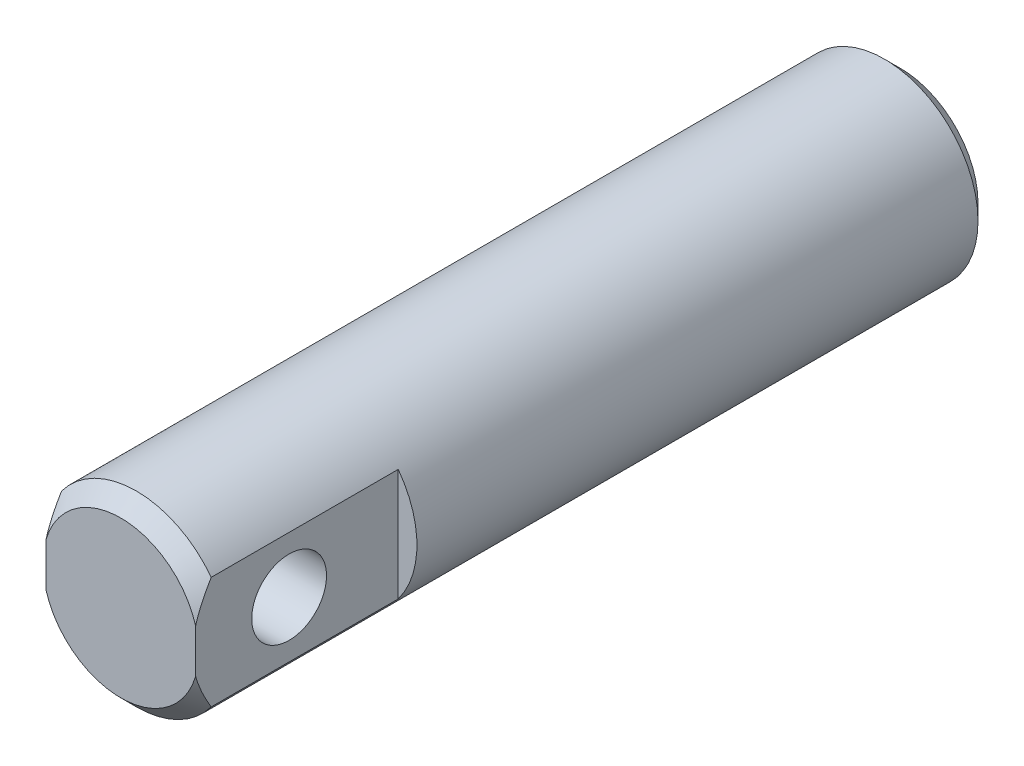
ISO-10303-21;
HEADER;
FILE_DESCRIPTION(('STEP AP214'),'2;1');
FILE_NAME('part.step','',(''),(''),'','','');
FILE_SCHEMA(('AUTOMOTIVE_DESIGN { 1 0 10303 214 1 1 1 1 }'));
ENDSEC;
DATA;
#1=APPLICATION_CONTEXT('core data for automotive mechanical design processes');
#2=APPLICATION_PROTOCOL_DEFINITION('international standard','automotive_design',2000,#1);
#3=PRODUCT_CONTEXT('',#1,'mechanical');
#4=PRODUCT('Part','Part','',(#3));
#5=PRODUCT_RELATED_PRODUCT_CATEGORY('part','',(#4));
#6=PRODUCT_DEFINITION_FORMATION('','',#4);
#7=PRODUCT_DEFINITION_CONTEXT('part definition',#1,'design');
#8=PRODUCT_DEFINITION('design','',#6,#7);
#9=PRODUCT_DEFINITION_SHAPE('','',#8);
#10=(LENGTH_UNIT() NAMED_UNIT(*) SI_UNIT(.MILLI.,.METRE.));
#11=(NAMED_UNIT(*) PLANE_ANGLE_UNIT() SI_UNIT($,.RADIAN.));
#12=(NAMED_UNIT(*) SI_UNIT($,.STERADIAN.) SOLID_ANGLE_UNIT());
#13=UNCERTAINTY_MEASURE_WITH_UNIT(LENGTH_MEASURE(1.E-05),#10,'distance_accuracy_value','');
#14=(GEOMETRIC_REPRESENTATION_CONTEXT(3) GLOBAL_UNCERTAINTY_ASSIGNED_CONTEXT((#13)) GLOBAL_UNIT_ASSIGNED_CONTEXT((#10,
#11,#12)) REPRESENTATION_CONTEXT('',''));
#15=CARTESIAN_POINT('',(0.,0.,0.));
#16=DIRECTION('',(0.,0.,1.));
#17=DIRECTION('',(1.,0.,0.));
#18=AXIS2_PLACEMENT_3D('',#15,#16,#17);
#19=CARTESIAN_POINT('',(0.,0.,0.));
#20=DIRECTION('',(0.,0.,1.));
#21=DIRECTION('',(1.,0.,0.));
#22=AXIS2_PLACEMENT_3D('',#19,#20,#21);
#23=PLANE('',#22);
#24=CARTESIAN_POINT('',(0.,0.,0.));
#25=DIRECTION('',(0.,0.,1.));
#26=DIRECTION('',(1.,0.,0.));
#27=AXIS2_PLACEMENT_3D('',#24,#25,#26);
#28=CIRCLE('',#27,2.5);
#29=CARTESIAN_POINT('',(2.5,0.,0.));
#30=VERTEX_POINT('',#29);
#31=EDGE_CURVE('E213',#30,#30,#28,.F.);
#32=ORIENTED_EDGE('',*,*,#31,.T.);
#33=EDGE_LOOP('',(#32));
#34=FACE_BOUND('',#33,.T.);
#35=DIRECTION('',(0.500185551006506,0.865918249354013,0.));
#36=VECTOR('',#35,1.);
#37=CARTESIAN_POINT('',(0.999257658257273,-1.7324791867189,0.));
#38=LINE('',#37,#36);
#39=CARTESIAN_POINT('',(0.999257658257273,-1.7324791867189,0.));
#40=VERTEX_POINT('',#39);
#41=CARTESIAN_POINT('',(2.,0.,0.));
#42=VERTEX_POINT('',#41);
#43=EDGE_CURVE('E50',#40,#42,#38,.T.);
#44=ORIENTED_EDGE('',*,*,#43,.T.);
#45=DIRECTION('',(-0.500185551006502,0.865918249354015,0.));
#46=VECTOR('',#45,1.);
#47=CARTESIAN_POINT('',(2.,0.,0.));
#48=LINE('',#47,#46);
#49=CARTESIAN_POINT('',(0.999257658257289,1.73247918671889,0.));
#50=VERTEX_POINT('',#49);
#51=EDGE_CURVE('E134',#42,#50,#48,.T.);
#52=ORIENTED_EDGE('',*,*,#51,.T.);
#53=DIRECTION('',(-1.,0.,0.));
#54=VECTOR('',#53,1.);
#55=CARTESIAN_POINT('',(0.999257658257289,1.73247918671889,0.));
#56=LINE('',#55,#54);
#57=CARTESIAN_POINT('',(-0.999257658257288,1.73247918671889,0.));
#58=VERTEX_POINT('',#57);
#59=EDGE_CURVE('E139',#50,#58,#56,.T.);
#60=ORIENTED_EDGE('',*,*,#59,.T.);
#61=DIRECTION('',(-0.500185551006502,-0.865918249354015,0.));
#62=VECTOR('',#61,1.);
#63=CARTESIAN_POINT('',(-0.999257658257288,1.73247918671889,0.));
#64=LINE('',#63,#62);
#65=CARTESIAN_POINT('',(-2.,0.,0.));
#66=VERTEX_POINT('',#65);
#67=EDGE_CURVE('E148',#58,#66,#64,.T.);
#68=ORIENTED_EDGE('',*,*,#67,.T.);
#69=DIRECTION('',(0.500185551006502,-0.865918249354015,0.));
#70=VECTOR('',#69,1.);
#71=CARTESIAN_POINT('',(-2.,0.,0.));
#72=LINE('',#71,#70);
#73=CARTESIAN_POINT('',(-0.999257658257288,-1.73247918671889,0.));
#74=VERTEX_POINT('',#73);
#75=EDGE_CURVE('E151',#66,#74,#72,.T.);
#76=ORIENTED_EDGE('',*,*,#75,.T.);
#77=DIRECTION('',(1.,0.,0.));
#78=VECTOR('',#77,1.);
#79=CARTESIAN_POINT('',(-0.999257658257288,-1.73247918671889,0.));
#80=LINE('',#79,#78);
#81=EDGE_CURVE('E144',#74,#40,#80,.T.);
#82=ORIENTED_EDGE('',*,*,#81,.T.);
#83=EDGE_LOOP('',(#44,#52,#60,#68,#76,#82));
#84=FACE_BOUND('',#83,.T.);
#85=ADVANCED_FACE('F34',(#34,#84),#23,.F.);
#86=CARTESIAN_POINT('',(0.,0.,25.));
#87=DIRECTION('',(0.,0.,-1.));
#88=DIRECTION('',(-1.,0.,0.));
#89=AXIS2_PLACEMENT_3D('',#86,#87,#88);
#90=CONICAL_SURFACE('',#89,2.49999999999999,0.785398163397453);
#91=CARTESIAN_POINT('',(-2.4,-4.86411981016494,22.0760105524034));
#92=CARTESIAN_POINT('',(-2.4,-4.75343904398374,22.1752525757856));
#93=CARTESIAN_POINT('',(-2.4,-4.6424406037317,22.2741434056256));
#94=CARTESIAN_POINT('',(-2.4,-4.41964149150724,22.471036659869));
#95=CARTESIAN_POINT('',(-2.4,-4.30784074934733,22.5690390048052));
#96=CARTESIAN_POINT('',(-2.4,-4.08288344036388,22.7643042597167));
#97=CARTESIAN_POINT('',(-2.4,-3.96972343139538,22.8615632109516));
#98=CARTESIAN_POINT('',(-2.4,-3.74223523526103,23.0546982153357));
#99=CARTESIAN_POINT('',(-2.4,-3.62790709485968,23.1505743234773));
#100=CARTESIAN_POINT('',(-2.4,-3.3910104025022,23.346179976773));
#101=CARTESIAN_POINT('',(-2.4,-3.26835369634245,23.4458030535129));
#102=CARTESIAN_POINT('',(-2.4,-3.02097816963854,23.6424528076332));
#103=CARTESIAN_POINT('',(-2.4,-2.89625945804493,23.739479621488));
#104=CARTESIAN_POINT('',(-2.4,-2.64434021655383,23.9298829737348));
#105=CARTESIAN_POINT('',(-2.4,-2.5171435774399,24.0232646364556));
#106=CARTESIAN_POINT('',(-2.4,-2.25931597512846,24.205135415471));
#107=CARTESIAN_POINT('',(-2.4,-2.12868602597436,24.2936259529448));
#108=CARTESIAN_POINT('',(-2.4,-1.89767283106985,24.4413252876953));
#109=CARTESIAN_POINT('',(-2.4,-1.79831993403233,24.5021369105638));
#110=CARTESIAN_POINT('',(-2.4,-1.59657013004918,24.6186387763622));
#111=CARTESIAN_POINT('',(-2.4,-1.4941720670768,24.6743270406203));
#112=CARTESIAN_POINT('',(-2.4,-1.28681517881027,24.7782510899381));
#113=CARTESIAN_POINT('',(-2.4,-1.18188921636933,24.8265516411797));
#114=CARTESIAN_POINT('',(-2.4,-0.968243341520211,24.9138789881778));
#115=CARTESIAN_POINT('',(-2.4,-0.859526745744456,24.9529136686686));
#116=CARTESIAN_POINT('',(-2.4,-0.67871397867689,25.0067783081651));
#117=CARTESIAN_POINT('',(-2.4,-0.607702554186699,25.0252458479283));
#118=CARTESIAN_POINT('',(-2.4,-0.464445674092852,25.056471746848));
#119=CARTESIAN_POINT('',(-2.4,-0.392200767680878,25.0692325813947));
#120=CARTESIAN_POINT('',(-2.4,-0.246990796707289,25.0883954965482));
#121=CARTESIAN_POINT('',(-2.4,-0.174027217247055,25.0948086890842));
#122=CARTESIAN_POINT('',(-2.4,-0.0278417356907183,25.1009482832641));
#123=CARTESIAN_POINT('',(-2.4,0.0453800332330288,25.1006777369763));
#124=CARTESIAN_POINT('',(-2.4,0.16956235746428,25.0945613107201));
#125=CARTESIAN_POINT('',(-2.4,0.220613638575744,25.090411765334));
#126=CARTESIAN_POINT('',(-2.4,0.322299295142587,25.0789822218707));
#127=CARTESIAN_POINT('',(-2.4,0.372934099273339,25.0717060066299));
#128=CARTESIAN_POINT('',(-2.4,0.510938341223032,25.0477310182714));
#129=CARTESIAN_POINT('',(-2.4,0.597797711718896,25.0280428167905));
#130=CARTESIAN_POINT('',(-2.4,0.76943571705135,24.981032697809));
#131=CARTESIAN_POINT('',(-2.4,0.854212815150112,24.9537053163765));
#132=CARTESIAN_POINT('',(-2.4,1.02248534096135,24.8924616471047));
#133=CARTESIAN_POINT('',(-2.4,1.10595291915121,24.8584697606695));
#134=CARTESIAN_POINT('',(-2.4,1.27057070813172,24.78542488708));
#135=CARTESIAN_POINT('',(-2.4,1.35172188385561,24.7463740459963));
#136=CARTESIAN_POINT('',(-2.4,1.57785101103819,24.6305367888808));
#137=CARTESIAN_POINT('',(-2.4,1.72044850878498,24.5491228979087));
#138=CARTESIAN_POINT('',(-2.4,2.00036407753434,24.3776204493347));
#139=CARTESIAN_POINT('',(-2.4,2.13767732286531,24.2875242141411));
#140=CARTESIAN_POINT('',(-2.4,2.40882965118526,24.1010670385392));
#141=CARTESIAN_POINT('',(-2.4,2.54265111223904,24.0046806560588));
#142=CARTESIAN_POINT('',(-2.4,2.80714311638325,23.8078094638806));
#143=CARTESIAN_POINT('',(-2.4,2.93781480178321,23.7073261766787));
#144=CARTESIAN_POINT('',(-2.4,3.18648942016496,23.511474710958));
#145=CARTESIAN_POINT('',(-2.4,3.30467335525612,23.4163353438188));
#146=CARTESIAN_POINT('',(-2.4,3.53946264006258,23.2241073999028));
#147=CARTESIAN_POINT('',(-2.4,3.65606781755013,23.1270186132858));
#148=CARTESIAN_POINT('',(-2.4,3.88690049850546,22.9322671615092));
#149=CARTESIAN_POINT('',(-2.4,4.00114006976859,22.8346187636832));
#150=CARTESIAN_POINT('',(-2.4,4.22856848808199,22.6381516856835));
#151=CARTESIAN_POINT('',(-2.4,4.34175754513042,22.5393332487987));
#152=CARTESIAN_POINT('',(-2.4,4.45454390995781,22.4400630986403));
#153=B_SPLINE_CURVE_WITH_KNOTS('',3,(#91,#92,#93,#94,#95,#96,#97,#98,#99,#100,#101,#102,#103,
#104,#105,#106,#107,#108,#109,#110,#111,#112,#113,#114,#115,#116,#117,#118,#119,#120,#121,#122,
#123,#124,#125,#126,#127,#128,#129,#130,#131,#132,#133,#134,#135,#136,#137,#138,#139,#140,#141,
#142,#143,#144,#145,#146,#147,#148,#149,#150,#151,#152),.UNSPECIFIED.,.F.,.F.,(4,2,2,2,2,2,2,2,
2,2,2,2,2,2,2,2,2,2,2,2,2,2,2,2,2,2,2,2,2,2,4),(0.,0.445976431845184,0.891992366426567,
1.33962217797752,1.78723413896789,2.26125979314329,2.7352604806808,3.208568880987,
3.6817390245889,4.03108709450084,4.38056952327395,4.72678680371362,5.07270840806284,
5.29263270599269,5.51246151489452,5.73190481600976,5.95124791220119,6.10481157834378,
6.25818997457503,6.52493203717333,6.79186537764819,7.06202293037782,7.33206625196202,
7.82413760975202,8.31664815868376,8.8112917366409,9.30575314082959,9.76088743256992,
10.2160709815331,10.6669202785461,11.1176774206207),.UNSPECIFIED.);
#154=CARTESIAN_POINT('',(-2.4,-1.80000000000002,24.5));
#155=VERTEX_POINT('',#154);
#156=CARTESIAN_POINT('',(-2.4,-0.699999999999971,25.));
#157=VERTEX_POINT('',#156);
#158=EDGE_CURVE('E43',#155,#157,#153,.T.);
#159=ORIENTED_EDGE('',*,*,#158,.F.);
#160=CARTESIAN_POINT('',(0.,0.,24.5));
#161=DIRECTION('',(0.,0.,1.));
#162=DIRECTION('',(1.,0.,0.));
#163=AXIS2_PLACEMENT_3D('',#160,#161,#162);
#164=CIRCLE('',#163,3.);
#165=CARTESIAN_POINT('',(2.4,-1.80000000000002,24.5));
#166=VERTEX_POINT('',#165);
#167=EDGE_CURVE('E210',#166,#155,#164,.F.);
#168=ORIENTED_EDGE('',*,*,#167,.F.);
#169=CARTESIAN_POINT('',(2.4,-4.86411981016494,22.0760105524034));
#170=CARTESIAN_POINT('',(2.4,-4.75343904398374,22.1752525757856));
#171=CARTESIAN_POINT('',(2.4,-4.6424406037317,22.2741434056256));
#172=CARTESIAN_POINT('',(2.4,-4.41964149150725,22.471036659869));
#173=CARTESIAN_POINT('',(2.4,-4.30784074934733,22.5690390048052));
#174=CARTESIAN_POINT('',(2.4,-4.08288344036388,22.7643042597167));
#175=CARTESIAN_POINT('',(2.4,-3.96972343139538,22.8615632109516));
#176=CARTESIAN_POINT('',(2.4,-3.74223523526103,23.0546982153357));
#177=CARTESIAN_POINT('',(2.4,-3.62790709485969,23.1505743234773));
#178=CARTESIAN_POINT('',(2.4,-3.3910104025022,23.346179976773));
#179=CARTESIAN_POINT('',(2.4,-3.26835369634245,23.4458030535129));
#180=CARTESIAN_POINT('',(2.4,-3.02097816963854,23.6424528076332));
#181=CARTESIAN_POINT('',(2.4,-2.89625945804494,23.739479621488));
#182=CARTESIAN_POINT('',(2.4,-2.64434021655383,23.9298829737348));
#183=CARTESIAN_POINT('',(2.4,-2.5171435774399,24.0232646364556));
#184=CARTESIAN_POINT('',(2.4,-2.25931597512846,24.205135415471));
#185=CARTESIAN_POINT('',(2.4,-2.12868602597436,24.2936259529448));
#186=CARTESIAN_POINT('',(2.4,-1.89767283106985,24.4413252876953));
#187=CARTESIAN_POINT('',(2.4,-1.79831993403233,24.5021369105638));
#188=CARTESIAN_POINT('',(2.4,-1.59657013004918,24.6186387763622));
#189=CARTESIAN_POINT('',(2.4,-1.4941720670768,24.6743270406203));
#190=CARTESIAN_POINT('',(2.4,-1.28681517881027,24.7782510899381));
#191=CARTESIAN_POINT('',(2.4,-1.18188921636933,24.8265516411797));
#192=CARTESIAN_POINT('',(2.4,-0.96824334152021,24.9138789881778));
#193=CARTESIAN_POINT('',(2.4,-0.859526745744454,24.9529136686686));
#194=CARTESIAN_POINT('',(2.4,-0.678713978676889,25.0067783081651));
#195=CARTESIAN_POINT('',(2.4,-0.607702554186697,25.0252458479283));
#196=CARTESIAN_POINT('',(2.4,-0.464445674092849,25.056471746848));
#197=CARTESIAN_POINT('',(2.4,-0.392200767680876,25.0692325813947));
#198=CARTESIAN_POINT('',(2.4,-0.246990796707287,25.0883954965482));
#199=CARTESIAN_POINT('',(2.4,-0.174027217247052,25.0948086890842));
#200=CARTESIAN_POINT('',(2.4,-0.0278417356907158,25.1009482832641));
#201=CARTESIAN_POINT('',(2.4,0.0453800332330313,25.1006777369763));
#202=CARTESIAN_POINT('',(2.4,0.169562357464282,25.0945613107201));
#203=CARTESIAN_POINT('',(2.4,0.220613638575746,25.090411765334));
#204=CARTESIAN_POINT('',(2.4,0.322299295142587,25.0789822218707));
#205=CARTESIAN_POINT('',(2.4,0.372934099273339,25.0717060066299));
#206=CARTESIAN_POINT('',(2.4,0.510938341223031,25.0477310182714));
#207=CARTESIAN_POINT('',(2.4,0.597797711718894,25.0280428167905));
#208=CARTESIAN_POINT('',(2.4,0.769435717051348,24.981032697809));
#209=CARTESIAN_POINT('',(2.4,0.85421281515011,24.9537053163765));
#210=CARTESIAN_POINT('',(2.4,1.02248534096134,24.8924616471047));
#211=CARTESIAN_POINT('',(2.4,1.10595291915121,24.8584697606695));
#212=CARTESIAN_POINT('',(2.4,1.27057070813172,24.78542488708));
#213=CARTESIAN_POINT('',(2.4,1.35172188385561,24.7463740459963));
#214=CARTESIAN_POINT('',(2.4,1.57785101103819,24.6305367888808));
#215=CARTESIAN_POINT('',(2.4,1.72044850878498,24.5491228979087));
#216=CARTESIAN_POINT('',(2.4,2.00036407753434,24.3776204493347));
#217=CARTESIAN_POINT('',(2.4,2.13767732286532,24.2875242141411));
#218=CARTESIAN_POINT('',(2.4,2.40882965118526,24.1010670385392));
#219=CARTESIAN_POINT('',(2.4,2.54265111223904,24.0046806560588));
#220=CARTESIAN_POINT('',(2.4,2.80714311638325,23.8078094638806));
#221=CARTESIAN_POINT('',(2.4,2.93781480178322,23.7073261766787));
#222=CARTESIAN_POINT('',(2.4,3.18648942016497,23.511474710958));
#223=CARTESIAN_POINT('',(2.4,3.30467335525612,23.4163353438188));
#224=CARTESIAN_POINT('',(2.4,3.53946264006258,23.2241073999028));
#225=CARTESIAN_POINT('',(2.4,3.65606781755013,23.1270186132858));
#226=CARTESIAN_POINT('',(2.4,3.88690049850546,22.9322671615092));
#227=CARTESIAN_POINT('',(2.4,4.00114006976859,22.8346187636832));
#228=CARTESIAN_POINT('',(2.4,4.22856848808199,22.6381516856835));
#229=CARTESIAN_POINT('',(2.4,4.34175754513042,22.5393332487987));
#230=CARTESIAN_POINT('',(2.4,4.45454390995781,22.4400630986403));
#231=B_SPLINE_CURVE_WITH_KNOTS('',3,(#169,#170,#171,#172,#173,#174,#175,#176,#177,#178,#179,
#180,#181,#182,#183,#184,#185,#186,#187,#188,#189,#190,#191,#192,#193,#194,#195,#196,#197,#198,
#199,#200,#201,#202,#203,#204,#205,#206,#207,#208,#209,#210,#211,#212,#213,#214,#215,#216,#217,
#218,#219,#220,#221,#222,#223,#224,#225,#226,#227,#228,#229,#230),.UNSPECIFIED.,.F.,.F.,(4,2,2,
2,2,2,2,2,2,2,2,2,2,2,2,2,2,2,2,2,2,2,2,2,2,2,2,2,2,2,4),(0.,0.445976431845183,
0.891992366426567,1.33962217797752,1.78723413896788,2.26125979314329,2.7352604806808,
3.208568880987,3.6817390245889,4.03108709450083,4.38056952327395,4.72678680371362,
5.07270840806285,5.2926327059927,5.51246151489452,5.73190481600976,5.95124791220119,
6.10481157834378,6.25818997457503,6.52493203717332,6.79186537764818,7.06202293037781,
7.33206625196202,7.82413760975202,8.31664815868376,8.8112917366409,9.3057531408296,
9.76088743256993,10.2160709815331,10.6669202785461,11.1176774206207),.UNSPECIFIED.);
#232=CARTESIAN_POINT('',(2.4,-0.699999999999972,25.));
#233=VERTEX_POINT('',#232);
#234=EDGE_CURVE('E216',#233,#166,#231,.F.);
#235=ORIENTED_EDGE('',*,*,#234,.F.);
#236=CARTESIAN_POINT('',(0.,0.,25.));
#237=DIRECTION('',(0.,0.,1.));
#238=DIRECTION('',(1.,0.,0.));
#239=AXIS2_PLACEMENT_3D('',#236,#237,#238);
#240=CIRCLE('',#239,2.49999999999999);
#241=EDGE_CURVE('E202',#157,#233,#240,.T.);
#242=ORIENTED_EDGE('',*,*,#241,.F.);
#243=EDGE_LOOP('',(#159,#168,#235,#242));
#244=FACE_BOUND('',#243,.T.);
#245=ADVANCED_FACE('F238',(#244),#90,.T.);
#246=CARTESIAN_POINT('',(0.,0.,25.));
#247=DIRECTION('',(0.,0.,-1.));
#248=DIRECTION('',(-1.,0.,0.));
#249=AXIS2_PLACEMENT_3D('',#246,#247,#248);
#250=CYLINDRICAL_SURFACE('',#249,3.);
#251=ORIENTED_EDGE('',*,*,#167,.T.);
#252=DIRECTION('',(0.,0.,-1.));
#253=VECTOR('',#252,1.);
#254=CARTESIAN_POINT('',(-2.4,-1.8,25.));
#255=LINE('',#254,#253);
#256=CARTESIAN_POINT('',(-2.4,-1.8,18.5));
#257=VERTEX_POINT('',#256);
#258=EDGE_CURVE('E187',#155,#257,#255,.T.);
#259=ORIENTED_EDGE('',*,*,#258,.T.);
#260=CARTESIAN_POINT('',(0.,0.,18.5));
#261=DIRECTION('',(0.,0.,-1.));
#262=DIRECTION('',(-1.,0.,0.));
#263=AXIS2_PLACEMENT_3D('',#260,#261,#262);
#264=CIRCLE('',#263,3.);
#265=CARTESIAN_POINT('',(-2.4,1.8,18.5));
#266=VERTEX_POINT('',#265);
#267=EDGE_CURVE('E11',#257,#266,#264,.T.);
#268=ORIENTED_EDGE('',*,*,#267,.T.);
#269=DIRECTION('',(0.,0.,-1.));
#270=VECTOR('',#269,1.);
#271=CARTESIAN_POINT('',(-2.4,1.8,25.));
#272=LINE('',#271,#270);
#273=CARTESIAN_POINT('',(-2.4,1.8,24.5));
#274=VERTEX_POINT('',#273);
#275=EDGE_CURVE('E184',#266,#274,#272,.F.);
#276=ORIENTED_EDGE('',*,*,#275,.T.);
#277=CARTESIAN_POINT('',(2.4,1.8,24.5));
#278=VERTEX_POINT('',#277);
#279=EDGE_CURVE('E209',#274,#278,#164,.F.);
#280=ORIENTED_EDGE('',*,*,#279,.T.);
#281=DIRECTION('',(0.,0.,-1.));
#282=VECTOR('',#281,1.);
#283=CARTESIAN_POINT('',(2.4,1.8,25.));
#284=LINE('',#283,#282);
#285=CARTESIAN_POINT('',(2.4,1.8,18.5));
#286=VERTEX_POINT('',#285);
#287=EDGE_CURVE('E199',#278,#286,#284,.T.);
#288=ORIENTED_EDGE('',*,*,#287,.T.);
#289=CARTESIAN_POINT('',(0.,0.,18.5));
#290=DIRECTION('',(0.,0.,-1.));
#291=DIRECTION('',(-1.,0.,0.));
#292=AXIS2_PLACEMENT_3D('',#289,#290,#291);
#293=CIRCLE('',#292,3.);
#294=CARTESIAN_POINT('',(2.4,-1.8,18.5));
#295=VERTEX_POINT('',#294);
#296=EDGE_CURVE('E225',#286,#295,#293,.T.);
#297=ORIENTED_EDGE('',*,*,#296,.T.);
#298=DIRECTION('',(0.,0.,-1.));
#299=VECTOR('',#298,1.);
#300=CARTESIAN_POINT('',(2.4,-1.8,25.));
#301=LINE('',#300,#299);
#302=EDGE_CURVE('E196',#295,#166,#301,.F.);
#303=ORIENTED_EDGE('',*,*,#302,.T.);
#304=EDGE_LOOP('',(#251,#259,#268,#276,#280,#288,#297,#303));
#305=FACE_BOUND('',#304,.T.);
#306=CARTESIAN_POINT('',(0.,0.,0.500000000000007));
#307=DIRECTION('',(0.,0.,1.));
#308=DIRECTION('',(1.,0.,0.));
#309=AXIS2_PLACEMENT_3D('',#306,#307,#308);
#310=CIRCLE('',#309,3.);
#311=CARTESIAN_POINT('',(3.,0.,0.500000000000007));
#312=VERTEX_POINT('',#311);
#313=EDGE_CURVE('E206',#312,#312,#310,.T.);
#314=ORIENTED_EDGE('',*,*,#313,.T.);
#315=EDGE_LOOP('',(#314));
#316=FACE_BOUND('',#315,.T.);
#317=ADVANCED_FACE('F36',(#305,#316),#250,.T.);
#318=CARTESIAN_POINT('',(0.,0.,25.));
#319=DIRECTION('',(0.,0.,1.));
#320=DIRECTION('',(1.,0.,0.));
#321=AXIS2_PLACEMENT_3D('',#318,#319,#320);
#322=PLANE('',#321);
#323=DIRECTION('',(0.,1.,0.));
#324=VECTOR('',#323,1.);
#325=CARTESIAN_POINT('',(-2.4,-3.,25.));
#326=LINE('',#325,#324);
#327=CARTESIAN_POINT('',(-2.4,0.699999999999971,25.));
#328=VERTEX_POINT('',#327);
#329=EDGE_CURVE('E58',#157,#328,#326,.T.);
#330=ORIENTED_EDGE('',*,*,#329,.F.);
#331=ORIENTED_EDGE('',*,*,#241,.T.);
#332=DIRECTION('',(0.,-1.,0.));
#333=VECTOR('',#332,1.);
#334=CARTESIAN_POINT('',(2.4,3.,25.));
#335=LINE('',#334,#333);
#336=CARTESIAN_POINT('',(2.4,0.699999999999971,25.));
#337=VERTEX_POINT('',#336);
#338=EDGE_CURVE('E190',#337,#233,#335,.T.);
#339=ORIENTED_EDGE('',*,*,#338,.F.);
#340=EDGE_CURVE('E203',#337,#328,#240,.T.);
#341=ORIENTED_EDGE('',*,*,#340,.T.);
#342=EDGE_LOOP('',(#330,#331,#339,#341));
#343=FACE_BOUND('',#342,.T.);
#344=ADVANCED_FACE('F236',(#343),#322,.T.);
#345=EDGE_CURVE('E240',#328,#274,#153,.T.);
#346=ORIENTED_EDGE('',*,*,#345,.F.);
#347=ORIENTED_EDGE('',*,*,#340,.F.);
#348=EDGE_CURVE('E224',#278,#337,#231,.F.);
#349=ORIENTED_EDGE('',*,*,#348,.F.);
#350=ORIENTED_EDGE('',*,*,#279,.F.);
#351=EDGE_LOOP('',(#346,#347,#349,#350));
#352=FACE_BOUND('',#351,.T.);
#353=ADVANCED_FACE('F231',(#352),#90,.T.);
#354=CARTESIAN_POINT('',(0.,0.,0.500000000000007));
#355=DIRECTION('',(0.,0.,1.));
#356=DIRECTION('',(1.,0.,0.));
#357=AXIS2_PLACEMENT_3D('',#354,#355,#356);
#358=CONICAL_SURFACE('',#357,3.,0.785398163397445);
#359=ORIENTED_EDGE('',*,*,#31,.F.);
#360=EDGE_LOOP('',(#359));
#361=FACE_BOUND('',#360,.T.);
#362=ORIENTED_EDGE('',*,*,#313,.F.);
#363=EDGE_LOOP('',(#362));
#364=FACE_BOUND('',#363,.T.);
#365=ADVANCED_FACE('F235',(#361,#364),#358,.T.);
#366=CARTESIAN_POINT('',(2.4,-3.,18.5));
#367=DIRECTION('',(0.,0.,-1.));
#368=DIRECTION('',(-1.,0.,0.));
#369=AXIS2_PLACEMENT_3D('',#366,#367,#368);
#370=PLANE('',#369);
#371=DIRECTION('',(0.,-1.,0.));
#372=VECTOR('',#371,1.);
#373=CARTESIAN_POINT('',(2.4,3.,18.5));
#374=LINE('',#373,#372);
#375=EDGE_CURVE('E193',#286,#295,#374,.T.);
#376=ORIENTED_EDGE('',*,*,#375,.T.);
#377=ORIENTED_EDGE('',*,*,#296,.F.);
#378=EDGE_LOOP('',(#376,#377));
#379=FACE_BOUND('',#378,.T.);
#380=ADVANCED_FACE('F254',(#379),#370,.F.);
#381=CARTESIAN_POINT('',(2.4,3.,18.5));
#382=DIRECTION('',(-1.,0.,0.));
#383=DIRECTION('',(0.,-1.,0.));
#384=AXIS2_PLACEMENT_3D('',#381,#382,#383);
#385=PLANE('',#384);
#386=CARTESIAN_POINT('',(2.4,0.,22.));
#387=DIRECTION('',(1.,0.,0.));
#388=DIRECTION('',(0.,1.,0.));
#389=AXIS2_PLACEMENT_3D('',#386,#387,#388);
#390=CIRCLE('',#389,1.2);
#391=CARTESIAN_POINT('',(2.4,1.2,22.));
#392=VERTEX_POINT('',#391);
#393=EDGE_CURVE('E130',#392,#392,#390,.T.);
#394=ORIENTED_EDGE('',*,*,#393,.F.);
#395=EDGE_LOOP('',(#394));
#396=FACE_BOUND('',#395,.T.);
#397=ORIENTED_EDGE('',*,*,#348,.T.);
#398=ORIENTED_EDGE('',*,*,#338,.T.);
#399=ORIENTED_EDGE('',*,*,#234,.T.);
#400=ORIENTED_EDGE('',*,*,#302,.F.);
#401=ORIENTED_EDGE('',*,*,#375,.F.);
#402=ORIENTED_EDGE('',*,*,#287,.F.);
#403=EDGE_LOOP('',(#397,#398,#399,#400,#401,#402));
#404=FACE_BOUND('',#403,.T.);
#405=ADVANCED_FACE('F227',(#396,#404),#385,.F.);
#406=CARTESIAN_POINT('',(-4.4,-3.,18.5));
#407=DIRECTION('',(0.,0.,-1.));
#408=DIRECTION('',(-1.,0.,0.));
#409=AXIS2_PLACEMENT_3D('',#406,#407,#408);
#410=PLANE('',#409);
#411=DIRECTION('',(0.,1.,0.));
#412=VECTOR('',#411,1.);
#413=CARTESIAN_POINT('',(-2.4,-3.,18.5));
#414=LINE('',#413,#412);
#415=EDGE_CURVE('E181',#257,#266,#414,.T.);
#416=ORIENTED_EDGE('',*,*,#415,.T.);
#417=ORIENTED_EDGE('',*,*,#267,.F.);
#418=EDGE_LOOP('',(#416,#417));
#419=FACE_BOUND('',#418,.T.);
#420=ADVANCED_FACE('F251',(#419),#410,.F.);
#421=CARTESIAN_POINT('',(-2.4,-3.,18.5));
#422=DIRECTION('',(1.,0.,0.));
#423=DIRECTION('',(0.,0.,-1.));
#424=AXIS2_PLACEMENT_3D('',#421,#422,#423);
#425=PLANE('',#424);
#426=CARTESIAN_POINT('',(-2.4,0.,22.));
#427=DIRECTION('',(1.,0.,0.));
#428=DIRECTION('',(0.,0.,-1.));
#429=AXIS2_PLACEMENT_3D('',#426,#427,#428);
#430=CIRCLE('',#429,1.2);
#431=CARTESIAN_POINT('',(-2.4,1.2,22.));
#432=VERTEX_POINT('',#431);
#433=EDGE_CURVE('E38',#432,#432,#430,.T.);
#434=ORIENTED_EDGE('',*,*,#433,.T.);
#435=EDGE_LOOP('',(#434));
#436=FACE_BOUND('',#435,.T.);
#437=ORIENTED_EDGE('',*,*,#158,.T.);
#438=ORIENTED_EDGE('',*,*,#329,.T.);
#439=ORIENTED_EDGE('',*,*,#345,.T.);
#440=ORIENTED_EDGE('',*,*,#275,.F.);
#441=ORIENTED_EDGE('',*,*,#415,.F.);
#442=ORIENTED_EDGE('',*,*,#258,.F.);
#443=EDGE_LOOP('',(#437,#438,#439,#440,#441,#442));
#444=FACE_BOUND('',#443,.T.);
#445=ADVANCED_FACE('F246',(#436,#444),#425,.F.);
#446=CARTESIAN_POINT('',(-3.,0.,22.));
#447=DIRECTION('',(1.,0.,0.));
#448=DIRECTION('',(0.,1.,0.));
#449=AXIS2_PLACEMENT_3D('',#446,#447,#448);
#450=CYLINDRICAL_SURFACE('',#449,1.2);
#451=CARTESIAN_POINT('',(2.4,1.2,22.));
#452=CARTESIAN_POINT('',(2.35,1.2,22.));
#453=CARTESIAN_POINT('',(2.3,1.2,22.));
#454=CARTESIAN_POINT('',(2.2,1.2,22.));
#455=CARTESIAN_POINT('',(2.15,1.2,22.));
#456=CARTESIAN_POINT('',(2.05,1.2,22.));
#457=CARTESIAN_POINT('',(2.,1.2,22.));
#458=CARTESIAN_POINT('',(1.9,1.2,22.));
#459=CARTESIAN_POINT('',(1.85,1.2,22.));
#460=CARTESIAN_POINT('',(1.75,1.2,22.));
#461=CARTESIAN_POINT('',(1.7,1.2,22.));
#462=CARTESIAN_POINT('',(1.6,1.2,22.));
#463=CARTESIAN_POINT('',(1.55,1.2,22.));
#464=CARTESIAN_POINT('',(1.45,1.2,22.));
#465=CARTESIAN_POINT('',(1.4,1.2,22.));
#466=CARTESIAN_POINT('',(1.3,1.2,22.));
#467=CARTESIAN_POINT('',(1.25,1.2,22.));
#468=CARTESIAN_POINT('',(1.15,1.2,22.));
#469=CARTESIAN_POINT('',(1.1,1.2,22.));
#470=CARTESIAN_POINT('',(1.,1.2,22.));
#471=CARTESIAN_POINT('',(0.95,1.2,22.));
#472=CARTESIAN_POINT('',(0.850000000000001,1.2,22.));
#473=CARTESIAN_POINT('',(0.800000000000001,1.2,22.));
#474=CARTESIAN_POINT('',(0.700000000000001,1.2,22.));
#475=CARTESIAN_POINT('',(0.650000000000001,1.2,22.));
#476=CARTESIAN_POINT('',(0.550000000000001,1.2,22.));
#477=CARTESIAN_POINT('',(0.500000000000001,1.2,22.));
#478=CARTESIAN_POINT('',(0.400000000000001,1.2,22.));
#479=CARTESIAN_POINT('',(0.35,1.2,22.));
#480=CARTESIAN_POINT('',(0.25,1.2,22.));
#481=CARTESIAN_POINT('',(0.2,1.2,22.));
#482=CARTESIAN_POINT('',(0.1,1.2,22.));
#483=CARTESIAN_POINT('',(0.0500000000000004,1.2,22.));
#484=CARTESIAN_POINT('',(-0.0499999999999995,1.2,22.));
#485=CARTESIAN_POINT('',(-0.0999999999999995,1.2,22.));
#486=CARTESIAN_POINT('',(-0.199999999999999,1.2,22.));
#487=CARTESIAN_POINT('',(-0.25,1.2,22.));
#488=CARTESIAN_POINT('',(-0.35,1.2,22.));
#489=CARTESIAN_POINT('',(-0.4,1.2,22.));
#490=CARTESIAN_POINT('',(-0.5,1.2,22.));
#491=CARTESIAN_POINT('',(-0.55,1.2,22.));
#492=CARTESIAN_POINT('',(-0.65,1.2,22.));
#493=CARTESIAN_POINT('',(-0.7,1.2,22.));
#494=CARTESIAN_POINT('',(-0.8,1.2,22.));
#495=CARTESIAN_POINT('',(-0.85,1.2,22.));
#496=CARTESIAN_POINT('',(-0.95,1.2,22.));
#497=CARTESIAN_POINT('',(-1.,1.2,22.));
#498=CARTESIAN_POINT('',(-1.1,1.2,22.));
#499=CARTESIAN_POINT('',(-1.15,1.2,22.));
#500=CARTESIAN_POINT('',(-1.25,1.2,22.));
#501=CARTESIAN_POINT('',(-1.3,1.2,22.));
#502=CARTESIAN_POINT('',(-1.4,1.2,22.));
#503=CARTESIAN_POINT('',(-1.45,1.2,22.));
#504=CARTESIAN_POINT('',(-1.55,1.2,22.));
#505=CARTESIAN_POINT('',(-1.6,1.2,22.));
#506=CARTESIAN_POINT('',(-1.7,1.2,22.));
#507=CARTESIAN_POINT('',(-1.75,1.2,22.));
#508=CARTESIAN_POINT('',(-1.85,1.2,22.));
#509=CARTESIAN_POINT('',(-1.9,1.2,22.));
#510=CARTESIAN_POINT('',(-2.,1.2,22.));
#511=CARTESIAN_POINT('',(-2.05,1.2,22.));
#512=CARTESIAN_POINT('',(-2.15,1.2,22.));
#513=CARTESIAN_POINT('',(-2.2,1.2,22.));
#514=CARTESIAN_POINT('',(-2.3,1.2,22.));
#515=CARTESIAN_POINT('',(-2.35,1.2,22.));
#516=CARTESIAN_POINT('',(-2.4,1.2,22.));
#517=B_SPLINE_CURVE_WITH_KNOTS('',3,(#451,#452,#453,#454,#455,#456,#457,#458,#459,#460,#461,
#462,#463,#464,#465,#466,#467,#468,#469,#470,#471,#472,#473,#474,#475,#476,#477,#478,#479,#480,
#481,#482,#483,#484,#485,#486,#487,#488,#489,#490,#491,#492,#493,#494,#495,#496,#497,#498,#499,
#500,#501,#502,#503,#504,#505,#506,#507,#508,#509,#510,#511,#512,#513,#514,#515,#516),
.UNSPECIFIED.,.F.,.F.,(4,2,2,2,2,2,2,2,2,2,2,2,2,2,2,2,2,2,2,2,2,2,2,2,2,2,2,2,2,2,2,2,4),(0.,
0.15,0.3,0.45,0.6,0.750000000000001,0.9,1.05,1.2,1.35,1.5,1.65,1.8,1.95,2.1,2.25,2.4,2.55,2.7,
2.85,3.,3.15,3.3,3.45,3.6,3.75,3.9,4.05,4.2,4.35,4.5,4.65,4.8),.UNSPECIFIED.);
#518=EDGE_CURVE('BSEAM250',#392,#432,#517,.T.);
#519=ORIENTED_EDGE('',*,*,#393,.T.);
#520=ORIENTED_EDGE('',*,*,#433,.F.);
#521=ORIENTED_EDGE('',*,*,#518,.T.);
#522=ORIENTED_EDGE('',*,*,#518,.F.);
#523=EDGE_LOOP('',(#519,#521,#520,#522));
#524=FACE_BOUND('',#523,.T.);
#525=ADVANCED_FACE('F250',(#524),#450,.F.);
#526=CARTESIAN_POINT('',(0.999257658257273,-1.7324791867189,3.5));
#527=DIRECTION('',(-0.865918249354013,0.500185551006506,0.));
#528=DIRECTION('',(-0.500185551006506,-0.865918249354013,0.));
#529=AXIS2_PLACEMENT_3D('',#526,#527,#528);
#530=PLANE('',#529);
#531=DIRECTION('',(0.,0.,-1.));
#532=VECTOR('',#531,1.);
#533=CARTESIAN_POINT('',(2.,0.,3.5));
#534=LINE('',#533,#532);
#535=CARTESIAN_POINT('',(2.,0.,3.5));
#536=VERTEX_POINT('',#535);
#537=EDGE_CURVE('E122',#536,#42,#534,.T.);
#538=ORIENTED_EDGE('',*,*,#537,.T.);
#539=ORIENTED_EDGE('',*,*,#43,.F.);
#540=DIRECTION('',(0.,0.,-1.));
#541=VECTOR('',#540,1.);
#542=CARTESIAN_POINT('',(0.999257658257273,-1.7324791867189,3.5));
#543=LINE('',#542,#541);
#544=CARTESIAN_POINT('',(0.999257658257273,-1.7324791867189,3.5));
#545=VERTEX_POINT('',#544);
#546=EDGE_CURVE('E169',#545,#40,#543,.T.);
#547=ORIENTED_EDGE('',*,*,#546,.F.);
#548=DIRECTION('',(0.500185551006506,0.865918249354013,0.));
#549=VECTOR('',#548,1.);
#550=CARTESIAN_POINT('',(0.999257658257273,-1.7324791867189,3.5));
#551=LINE('',#550,#549);
#552=EDGE_CURVE('E126',#545,#536,#551,.T.);
#553=ORIENTED_EDGE('',*,*,#552,.T.);
#554=EDGE_LOOP('',(#538,#539,#547,#553));
#555=FACE_BOUND('',#554,.T.);
#556=ADVANCED_FACE('F124',(#555),#530,.T.);
#557=CARTESIAN_POINT('',(2.,0.,3.5));
#558=DIRECTION('',(-0.865918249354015,-0.500185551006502,0.));
#559=DIRECTION('',(0.500185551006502,-0.865918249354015,0.));
#560=AXIS2_PLACEMENT_3D('',#557,#558,#559);
#561=PLANE('',#560);
#562=DIRECTION('',(0.,0.,-1.));
#563=VECTOR('',#562,1.);
#564=CARTESIAN_POINT('',(0.999257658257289,1.73247918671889,3.5));
#565=LINE('',#564,#563);
#566=CARTESIAN_POINT('',(0.999257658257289,1.73247918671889,3.5));
#567=VERTEX_POINT('',#566);
#568=EDGE_CURVE('E131',#567,#50,#565,.T.);
#569=ORIENTED_EDGE('',*,*,#568,.T.);
#570=ORIENTED_EDGE('',*,*,#51,.F.);
#571=ORIENTED_EDGE('',*,*,#537,.F.);
#572=DIRECTION('',(-0.500185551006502,0.865918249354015,0.));
#573=VECTOR('',#572,1.);
#574=CARTESIAN_POINT('',(2.,0.,3.5));
#575=LINE('',#574,#573);
#576=EDGE_CURVE('E155',#536,#567,#575,.T.);
#577=ORIENTED_EDGE('',*,*,#576,.T.);
#578=EDGE_LOOP('',(#569,#570,#571,#577));
#579=FACE_BOUND('',#578,.T.);
#580=ADVANCED_FACE('F135',(#579),#561,.T.);
#581=CARTESIAN_POINT('',(0.999257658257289,1.73247918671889,3.5));
#582=DIRECTION('',(0.,-1.,0.));
#583=DIRECTION('',(0.,0.,-1.));
#584=AXIS2_PLACEMENT_3D('',#581,#582,#583);
#585=PLANE('',#584);
#586=DIRECTION('',(0.,0.,-1.));
#587=VECTOR('',#586,1.);
#588=CARTESIAN_POINT('',(-0.999257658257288,1.73247918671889,3.5));
#589=LINE('',#588,#587);
#590=CARTESIAN_POINT('',(-0.999257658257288,1.73247918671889,3.5));
#591=VERTEX_POINT('',#590);
#592=EDGE_CURVE('E175',#591,#58,#589,.T.);
#593=ORIENTED_EDGE('',*,*,#592,.T.);
#594=ORIENTED_EDGE('',*,*,#59,.F.);
#595=ORIENTED_EDGE('',*,*,#568,.F.);
#596=DIRECTION('',(-1.,0.,0.));
#597=VECTOR('',#596,1.);
#598=CARTESIAN_POINT('',(0.999257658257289,1.73247918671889,3.5));
#599=LINE('',#598,#597);
#600=EDGE_CURVE('E157',#567,#591,#599,.T.);
#601=ORIENTED_EDGE('',*,*,#600,.T.);
#602=EDGE_LOOP('',(#593,#594,#595,#601));
#603=FACE_BOUND('',#602,.T.);
#604=ADVANCED_FACE('F318',(#603),#585,.T.);
#605=CARTESIAN_POINT('',(-0.999257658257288,1.73247918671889,3.5));
#606=DIRECTION('',(0.865918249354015,-0.500185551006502,0.));
#607=DIRECTION('',(0.500185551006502,0.865918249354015,0.));
#608=AXIS2_PLACEMENT_3D('',#605,#606,#607);
#609=PLANE('',#608);
#610=DIRECTION('',(0.,0.,-1.));
#611=VECTOR('',#610,1.);
#612=CARTESIAN_POINT('',(-2.,0.,3.5));
#613=LINE('',#612,#611);
#614=CARTESIAN_POINT('',(-2.,0.,3.5));
#615=VERTEX_POINT('',#614);
#616=EDGE_CURVE('E173',#615,#66,#613,.T.);
#617=ORIENTED_EDGE('',*,*,#616,.T.);
#618=ORIENTED_EDGE('',*,*,#67,.F.);
#619=ORIENTED_EDGE('',*,*,#592,.F.);
#620=DIRECTION('',(-0.500185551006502,-0.865918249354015,0.));
#621=VECTOR('',#620,1.);
#622=CARTESIAN_POINT('',(-0.999257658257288,1.73247918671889,3.5));
#623=LINE('',#622,#621);
#624=EDGE_CURVE('E160',#591,#615,#623,.T.);
#625=ORIENTED_EDGE('',*,*,#624,.T.);
#626=EDGE_LOOP('',(#617,#618,#619,#625));
#627=FACE_BOUND('',#626,.T.);
#628=ADVANCED_FACE('F325',(#627),#609,.T.);
#629=CARTESIAN_POINT('',(-2.,0.,3.5));
#630=DIRECTION('',(0.865918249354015,0.500185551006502,0.));
#631=DIRECTION('',(-0.500185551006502,0.865918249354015,0.));
#632=AXIS2_PLACEMENT_3D('',#629,#630,#631);
#633=PLANE('',#632);
#634=DIRECTION('',(0.,0.,-1.));
#635=VECTOR('',#634,1.);
#636=CARTESIAN_POINT('',(-0.999257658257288,-1.73247918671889,3.5));
#637=LINE('',#636,#635);
#638=CARTESIAN_POINT('',(-0.999257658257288,-1.73247918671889,3.5));
#639=VERTEX_POINT('',#638);
#640=EDGE_CURVE('E171',#639,#74,#637,.T.);
#641=ORIENTED_EDGE('',*,*,#640,.T.);
#642=ORIENTED_EDGE('',*,*,#75,.F.);
#643=ORIENTED_EDGE('',*,*,#616,.F.);
#644=DIRECTION('',(0.500185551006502,-0.865918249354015,0.));
#645=VECTOR('',#644,1.);
#646=CARTESIAN_POINT('',(-2.,0.,3.5));
#647=LINE('',#646,#645);
#648=EDGE_CURVE('E163',#615,#639,#647,.T.);
#649=ORIENTED_EDGE('',*,*,#648,.T.);
#650=EDGE_LOOP('',(#641,#642,#643,#649));
#651=FACE_BOUND('',#650,.T.);
#652=ADVANCED_FACE('F333',(#651),#633,.T.);
#653=CARTESIAN_POINT('',(-0.999257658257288,-1.73247918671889,3.5));
#654=DIRECTION('',(0.,1.,0.));
#655=DIRECTION('',(-1.,0.,0.));
#656=AXIS2_PLACEMENT_3D('',#653,#654,#655);
#657=PLANE('',#656);
#658=DIRECTION('',(1.,0.,0.));
#659=VECTOR('',#658,1.);
#660=CARTESIAN_POINT('',(-0.999257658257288,-1.73247918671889,3.5));
#661=LINE('',#660,#659);
#662=EDGE_CURVE('E166',#639,#545,#661,.T.);
#663=ORIENTED_EDGE('',*,*,#662,.T.);
#664=ORIENTED_EDGE('',*,*,#546,.T.);
#665=ORIENTED_EDGE('',*,*,#81,.F.);
#666=ORIENTED_EDGE('',*,*,#640,.F.);
#667=EDGE_LOOP('',(#663,#664,#665,#666));
#668=FACE_BOUND('',#667,.T.);
#669=ADVANCED_FACE('F341',(#668),#657,.T.);
#670=CARTESIAN_POINT('',(0.,-3.46238809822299,3.5));
#671=DIRECTION('',(0.,0.,-1.));
#672=DIRECTION('',(-1.,0.,0.));
#673=AXIS2_PLACEMENT_3D('',#670,#671,#672);
#674=PLANE('',#673);
#675=ORIENTED_EDGE('',*,*,#552,.F.);
#676=ORIENTED_EDGE('',*,*,#662,.F.);
#677=ORIENTED_EDGE('',*,*,#648,.F.);
#678=ORIENTED_EDGE('',*,*,#624,.F.);
#679=ORIENTED_EDGE('',*,*,#600,.F.);
#680=ORIENTED_EDGE('',*,*,#576,.F.);
#681=EDGE_LOOP('',(#675,#676,#677,#678,#679,#680));
#682=FACE_BOUND('',#681,.T.);
#683=ADVANCED_FACE('F344',(#682),#674,.T.);
#684=CLOSED_SHELL('',(#85,#245,#317,#344,#353,#365,#380,#405,#420,#445,#525,#556,#580,#604,#628,
#652,#669,#683));
#685=MANIFOLD_SOLID_BREP('B2',#684);
#686=ADVANCED_BREP_SHAPE_REPRESENTATION('',(#18,#685),#14);
#687=SHAPE_DEFINITION_REPRESENTATION(#9,#686);
ENDSEC;
END-ISO-10303-21;
